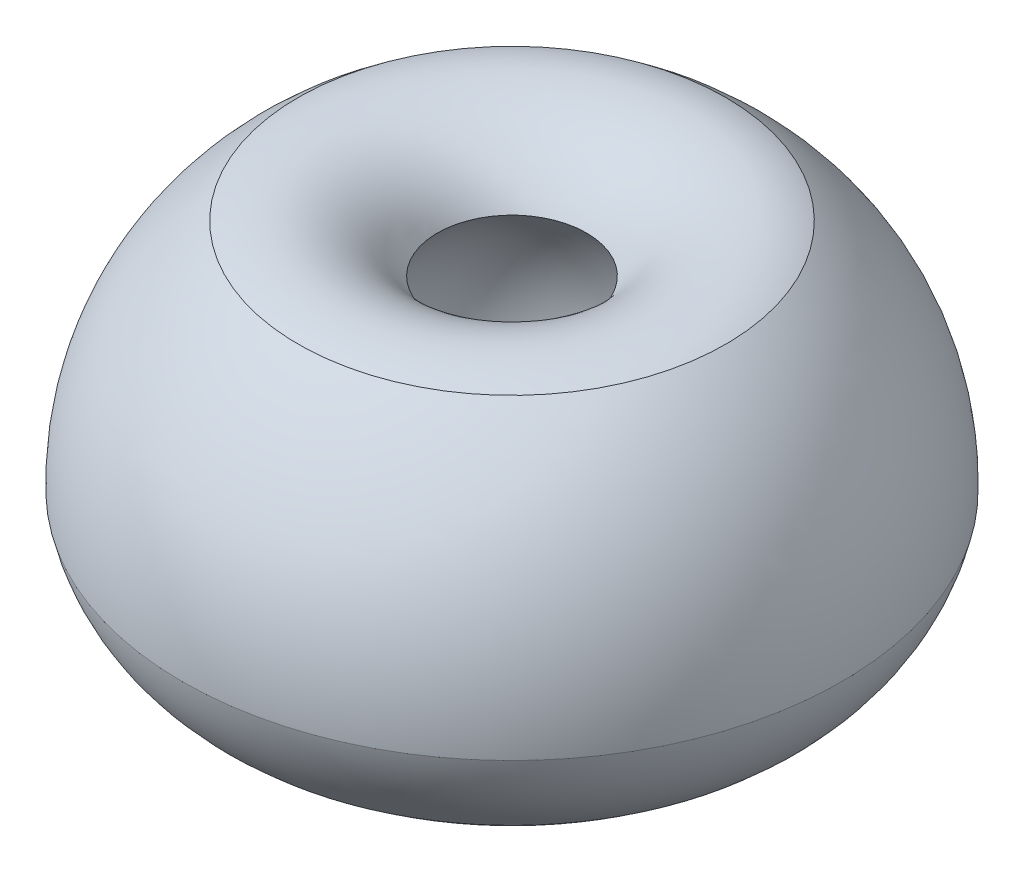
ISO-10303-21;
HEADER;
FILE_DESCRIPTION(('STEP AP214'),'2;1');
FILE_NAME('part.step','',(''),(''),'','','');
FILE_SCHEMA(('AUTOMOTIVE_DESIGN { 1 0 10303 214 1 1 1 1 }'));
ENDSEC;
DATA;
#1=APPLICATION_CONTEXT('core data for automotive mechanical design processes');
#2=APPLICATION_PROTOCOL_DEFINITION('international standard','automotive_design',2000,#1);
#3=PRODUCT_CONTEXT('',#1,'mechanical');
#4=PRODUCT('Part','Part','',(#3));
#5=PRODUCT_RELATED_PRODUCT_CATEGORY('part','',(#4));
#6=PRODUCT_DEFINITION_FORMATION('','',#4);
#7=PRODUCT_DEFINITION_CONTEXT('part definition',#1,'design');
#8=PRODUCT_DEFINITION('design','',#6,#7);
#9=PRODUCT_DEFINITION_SHAPE('','',#8);
#10=(LENGTH_UNIT() NAMED_UNIT(*) SI_UNIT(.MILLI.,.METRE.));
#11=(NAMED_UNIT(*) PLANE_ANGLE_UNIT() SI_UNIT($,.RADIAN.));
#12=(NAMED_UNIT(*) SI_UNIT($,.STERADIAN.) SOLID_ANGLE_UNIT());
#13=UNCERTAINTY_MEASURE_WITH_UNIT(LENGTH_MEASURE(1.E-05),#10,'distance_accuracy_value','');
#14=(GEOMETRIC_REPRESENTATION_CONTEXT(3) GLOBAL_UNCERTAINTY_ASSIGNED_CONTEXT((#13)) GLOBAL_UNIT_ASSIGNED_CONTEXT((#10,
#11,#12)) REPRESENTATION_CONTEXT('',''));
#15=CARTESIAN_POINT('',(0.,0.,0.));
#16=DIRECTION('',(0.,0.,1.));
#17=DIRECTION('',(1.,0.,0.));
#18=AXIS2_PLACEMENT_3D('',#15,#16,#17);
#19=CARTESIAN_POINT('',(0.,862.97458072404,0.));
#20=DIRECTION('',(0.,-1.,0.));
#21=DIRECTION('',(0.,0.,-1.));
#22=AXIS2_PLACEMENT_3D('',#19,#20,#21);
#23=DEGENERATE_TOROIDAL_SURFACE('',#22,457.769627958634,2591.92821206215,.T.);
#24=CARTESIAN_POINT('',(0.,794.407108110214,0.));
#25=DIRECTION('',(0.,-1.,0.));
#26=DIRECTION('',(0.,0.,-1.));
#27=AXIS2_PLACEMENT_3D('',#24,#25,#26);
#28=CIRCLE('',#27,3048.79073134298);
#29=CARTESIAN_POINT('',(0.,794.407108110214,-3048.79073134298));
#30=VERTEX_POINT('',#29);
#31=EDGE_CURVE('E9',#30,#30,#28,.T.);
#32=ORIENTED_EDGE('',*,*,#31,.F.);
#33=EDGE_LOOP('',(#32));
#34=FACE_BOUND('',#33,.T.);
#35=CARTESIAN_POINT('',(0.,2962.52683735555,0.));
#36=DIRECTION('',(0.,-1.,0.));
#37=DIRECTION('',(0.,0.,-1.));
#38=AXIS2_PLACEMENT_3D('',#35,#36,#37);
#39=CIRCLE('',#38,1977.62889057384);
#40=CARTESIAN_POINT('',(0.,2962.52683735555,-1977.62889057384));
#41=VERTEX_POINT('',#40);
#42=EDGE_CURVE('E35',#41,#41,#39,.T.);
#43=ORIENTED_EDGE('',*,*,#42,.T.);
#44=EDGE_LOOP('',(#43));
#45=FACE_BOUND('',#44,.T.);
#46=ADVANCED_FACE('F13',(#34,#45),#23,.T.);
#47=CARTESIAN_POINT('',(0.,1129.75999735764,0.));
#48=DIRECTION('',(0.,-1.,0.));
#49=DIRECTION('',(0.,0.,-1.));
#50=AXIS2_PLACEMENT_3D('',#47,#48,#49);
#51=DEGENERATE_TOROIDAL_SURFACE('',#50,1474.22211760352,1609.88443054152,.T.);
#52=CARTESIAN_POINT('',(0.,-329.014538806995,0.));
#53=DIRECTION('',(0.,-1.,0.));
#54=DIRECTION('',(0.,0.,-1.));
#55=AXIS2_PLACEMENT_3D('',#52,#53,#54);
#56=CIRCLE('',#55,793.263431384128);
#57=CARTESIAN_POINT('',(0.,-329.014538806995,-793.263431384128));
#58=VERTEX_POINT('',#57);
#59=EDGE_CURVE('E19',#58,#58,#56,.T.);
#60=ORIENTED_EDGE('',*,*,#59,.F.);
#61=EDGE_LOOP('',(#60));
#62=FACE_BOUND('',#61,.T.);
#63=ORIENTED_EDGE('',*,*,#31,.T.);
#64=EDGE_LOOP('',(#63));
#65=FACE_BOUND('',#64,.T.);
#66=ADVANCED_FACE('F60',(#62,#65),#51,.T.);
#67=CARTESIAN_POINT('',(0.,-329.014538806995,0.));
#68=DIRECTION('',(0.,-1.,0.));
#69=DIRECTION('',(0.,0.,-1.));
#70=AXIS2_PLACEMENT_3D('',#67,#68,#69);
#71=CONICAL_SURFACE('',#70,793.263431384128,0.0130711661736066);
#72=CARTESIAN_POINT('',(0.,-26.4444908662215,0.));
#73=DIRECTION('',(0.,-1.,0.));
#74=DIRECTION('',(0.,0.,-1.));
#75=AXIS2_PLACEMENT_3D('',#72,#73,#74);
#76=CIRCLE('',#75,789.308262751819);
#77=CARTESIAN_POINT('',(0.,-26.4444908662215,-789.308262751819));
#78=VERTEX_POINT('',#77);
#79=EDGE_CURVE('E23',#78,#78,#76,.T.);
#80=ORIENTED_EDGE('',*,*,#79,.F.);
#81=EDGE_LOOP('',(#80));
#82=FACE_BOUND('',#81,.T.);
#83=ORIENTED_EDGE('',*,*,#59,.T.);
#84=EDGE_LOOP('',(#83));
#85=FACE_BOUND('',#84,.T.);
#86=ADVANCED_FACE('F55',(#82,#85),#71,.F.);
#87=CARTESIAN_POINT('',(0.,752.640999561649,0.));
#88=DIRECTION('',(0.,-1.,0.));
#89=DIRECTION('',(0.,0.,-1.));
#90=AXIS2_PLACEMENT_3D('',#87,#88,#89);
#91=DEGENERATE_TOROIDAL_SURFACE('',#90,426.756448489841,859.312527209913,.T.);
#92=CARTESIAN_POINT('',(0.,1214.07144647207,0.));
#93=DIRECTION('',(0.,-1.,0.));
#94=DIRECTION('',(0.,0.,-1.));
#95=AXIS2_PLACEMENT_3D('',#92,#93,#94);
#96=CIRCLE('',#95,1151.6702103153);
#97=CARTESIAN_POINT('',(0.,1214.07144647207,-1151.6702103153));
#98=VERTEX_POINT('',#97);
#99=EDGE_CURVE('E27',#98,#98,#96,.T.);
#100=ORIENTED_EDGE('',*,*,#99,.F.);
#101=EDGE_LOOP('',(#100));
#102=FACE_BOUND('',#101,.T.);
#103=ORIENTED_EDGE('',*,*,#79,.T.);
#104=EDGE_LOOP('',(#103));
#105=FACE_BOUND('',#104,.T.);
#106=ADVANCED_FACE('F49',(#102,#105),#91,.F.);
#107=CARTESIAN_POINT('',(0.,1383.00000000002,0.));
#108=DIRECTION('',(0.,-1.,0.));
#109=DIRECTION('',(0.,0.,-1.));
#110=AXIS2_PLACEMENT_3D('',#107,#108,#109);
#111=DEGENERATE_TOROIDAL_SURFACE('',#110,449.32667397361,1609.88443054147,.F.);
#112=CARTESIAN_POINT('',(0.,2520.89807956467,0.));
#113=DIRECTION('',(0.,-1.,0.));
#114=DIRECTION('',(0.,0.,-1.));
#115=AXIS2_PLACEMENT_3D('',#112,#113,#114);
#116=CIRCLE('',#115,689.495454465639);
#117=CARTESIAN_POINT('',(0.,2520.89807956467,-689.495454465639));
#118=VERTEX_POINT('',#117);
#119=EDGE_CURVE('E32',#118,#118,#116,.T.);
#120=ORIENTED_EDGE('',*,*,#119,.F.);
#121=EDGE_LOOP('',(#120));
#122=FACE_BOUND('',#121,.T.);
#123=ORIENTED_EDGE('',*,*,#99,.T.);
#124=EDGE_LOOP('',(#123));
#125=FACE_BOUND('',#124,.T.);
#126=ADVANCED_FACE('F43',(#122,#125),#111,.T.);
#127=CARTESIAN_POINT('',(0.,2015.16638678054,0.));
#128=DIRECTION('',(0.,-1.,0.));
#129=DIRECTION('',(0.,0.,-1.));
#130=AXIS2_PLACEMENT_3D('',#127,#128,#129);
#131=TOROIDAL_SURFACE('',#130,1582.65409896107,1026.39997531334);
#132=ORIENTED_EDGE('',*,*,#42,.F.);
#133=EDGE_LOOP('',(#132));
#134=FACE_BOUND('',#133,.T.);
#135=ORIENTED_EDGE('',*,*,#119,.T.);
#136=EDGE_LOOP('',(#135));
#137=FACE_BOUND('',#136,.T.);
#138=ADVANCED_FACE('F40',(#134,#137),#131,.T.);
#139=CLOSED_SHELL('',(#46,#66,#86,#106,#126,#138));
#140=MANIFOLD_SOLID_BREP('B1',#139);
#141=ADVANCED_BREP_SHAPE_REPRESENTATION('',(#18,#140),#14);
#142=SHAPE_DEFINITION_REPRESENTATION(#9,#141);
ENDSEC;
END-ISO-10303-21;
